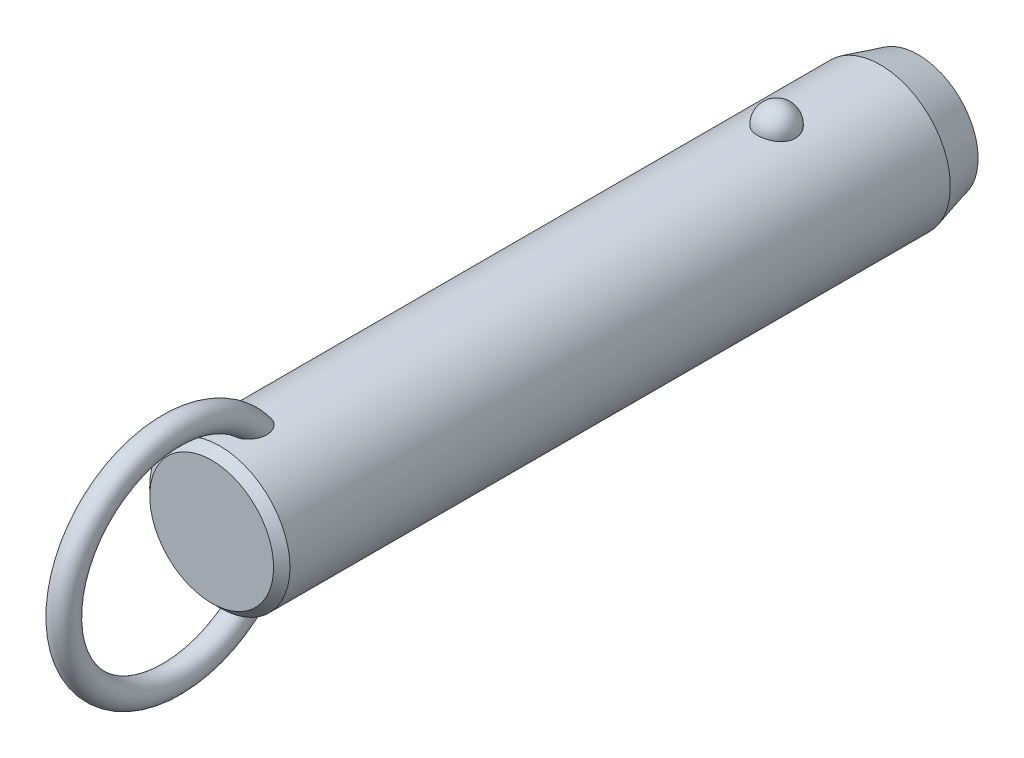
ISO-10303-21;
HEADER;
FILE_DESCRIPTION(('STEP AP214'),'2;1');
FILE_NAME('part.step','',(''),(''),'','','');
FILE_SCHEMA(('AUTOMOTIVE_DESIGN { 1 0 10303 214 1 1 1 1 }'));
ENDSEC;
DATA;
#1=APPLICATION_CONTEXT('core data for automotive mechanical design processes');
#2=APPLICATION_PROTOCOL_DEFINITION('international standard','automotive_design',2000,#1);
#3=PRODUCT_CONTEXT('',#1,'mechanical');
#4=PRODUCT('Part','Part','',(#3));
#5=PRODUCT_RELATED_PRODUCT_CATEGORY('part','',(#4));
#6=PRODUCT_DEFINITION_FORMATION('','',#4);
#7=PRODUCT_DEFINITION_CONTEXT('part definition',#1,'design');
#8=PRODUCT_DEFINITION('design','',#6,#7);
#9=PRODUCT_DEFINITION_SHAPE('','',#8);
#10=(LENGTH_UNIT() NAMED_UNIT(*) SI_UNIT(.MILLI.,.METRE.));
#11=(NAMED_UNIT(*) PLANE_ANGLE_UNIT() SI_UNIT($,.RADIAN.));
#12=(NAMED_UNIT(*) SI_UNIT($,.STERADIAN.) SOLID_ANGLE_UNIT());
#13=UNCERTAINTY_MEASURE_WITH_UNIT(LENGTH_MEASURE(1.E-05),#10,'distance_accuracy_value','');
#14=(GEOMETRIC_REPRESENTATION_CONTEXT(3) GLOBAL_UNCERTAINTY_ASSIGNED_CONTEXT((#13)) GLOBAL_UNIT_ASSIGNED_CONTEXT((#10,
#11,#12)) REPRESENTATION_CONTEXT('',''));
#15=CARTESIAN_POINT('',(0.,0.,0.));
#16=DIRECTION('',(0.,0.,1.));
#17=DIRECTION('',(1.,0.,0.));
#18=AXIS2_PLACEMENT_3D('',#15,#16,#17);
#19=CARTESIAN_POINT('',(0.,0.,73.7));
#20=DIRECTION('',(0.,0.,-1.));
#21=DIRECTION('',(-1.,0.,0.));
#22=AXIS2_PLACEMENT_3D('',#19,#20,#21);
#23=CYLINDRICAL_SURFACE('',#22,11.1);
#24=CARTESIAN_POINT('',(2.9724815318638,10.6945945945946,-3.));
#25=CARTESIAN_POINT('',(2.97247830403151,10.6945972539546,-2.83225059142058));
#26=CARTESIAN_POINT('',(2.95876598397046,10.6984356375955,-2.66445972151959));
#27=CARTESIAN_POINT('',(2.90424529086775,10.7133624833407,-2.33362381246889));
#28=CARTESIAN_POINT('',(2.8634252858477,10.7244540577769,-2.1705808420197));
#29=CARTESIAN_POINT('',(2.75573657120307,10.7526272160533,-1.85396767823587));
#30=CARTESIAN_POINT('',(2.68887937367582,10.7697061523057,-1.70039333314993));
#31=CARTESIAN_POINT('',(2.53079696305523,10.8079438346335,-1.40691598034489));
#32=CARTESIAN_POINT('',(2.43957264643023,10.8291024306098,-1.2670124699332));
#33=CARTESIAN_POINT('',(2.23458150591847,10.8732541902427,-1.00409565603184));
#34=CARTESIAN_POINT('',(2.12071295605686,10.8962553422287,-0.881162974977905));
#35=CARTESIAN_POINT('',(1.87365402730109,10.9414421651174,-0.656352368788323));
#36=CARTESIAN_POINT('',(1.74046358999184,10.9636278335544,-0.554474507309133));
#37=CARTESIAN_POINT('',(1.45872188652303,11.0046495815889,-0.374872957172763));
#38=CARTESIAN_POINT('',(1.31021276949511,11.0234944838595,-0.297085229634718));
#39=CARTESIAN_POINT('',(1.00170030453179,11.0557957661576,-0.167529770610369));
#40=CARTESIAN_POINT('',(0.841698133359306,11.0692526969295,-0.115759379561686));
#41=CARTESIAN_POINT('',(0.517607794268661,11.0890932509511,-0.0403925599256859));
#42=CARTESIAN_POINT('',(0.353633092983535,11.0955916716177,-0.0163383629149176));
#43=CARTESIAN_POINT('',(0.0238420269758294,11.1011989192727,0.0044517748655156));
#44=CARTESIAN_POINT('',(-0.141974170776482,11.1003084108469,0.00119017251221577));
#45=CARTESIAN_POINT('',(-0.468405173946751,11.0912990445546,-0.0323233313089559));
#46=CARTESIAN_POINT('',(-0.629059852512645,11.0832767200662,-0.0622147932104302));
#47=CARTESIAN_POINT('',(-0.942937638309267,11.0609962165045,-0.147645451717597));
#48=CARTESIAN_POINT('',(-1.09616062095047,11.0467379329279,-0.203185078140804));
#49=CARTESIAN_POINT('',(-1.39181061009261,11.0134071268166,-0.3387529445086));
#50=CARTESIAN_POINT('',(-1.53417383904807,10.9943086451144,-0.418913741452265));
#51=CARTESIAN_POINT('',(-1.80342160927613,10.9533667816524,-0.60144882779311));
#52=CARTESIAN_POINT('',(-1.9303046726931,10.9315231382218,-0.703825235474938));
#53=CARTESIAN_POINT('',(-2.16747598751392,10.887005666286,-0.930091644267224));
#54=CARTESIAN_POINT('',(-2.27742774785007,10.8643239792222,-1.05433291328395));
#55=CARTESIAN_POINT('',(-2.47517316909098,10.8209886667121,-1.31966633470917));
#56=CARTESIAN_POINT('',(-2.56296538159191,10.8003351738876,-1.46075958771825));
#57=CARTESIAN_POINT('',(-2.71500300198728,10.7631304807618,-1.75753646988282));
#58=CARTESIAN_POINT('',(-2.77898901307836,10.7466250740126,-1.91335887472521));
#59=CARTESIAN_POINT('',(-2.88046189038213,10.7198747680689,-2.2339152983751));
#60=CARTESIAN_POINT('',(-2.91794947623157,10.709629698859,-2.39864907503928));
#61=CARTESIAN_POINT('',(-2.96537819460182,10.6965949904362,-2.73165170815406));
#62=CARTESIAN_POINT('',(-2.97542891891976,10.693775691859,-2.89990378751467));
#63=CARTESIAN_POINT('',(-2.96804271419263,10.6958279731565,-3.235752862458));
#64=CARTESIAN_POINT('',(-2.95060646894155,10.7006993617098,-3.40334987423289));
#65=CARTESIAN_POINT('',(-2.88883358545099,10.71753912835,-3.73233906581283));
#66=CARTESIAN_POINT('',(-2.84462026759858,10.7294749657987,-3.89375610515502));
#67=CARTESIAN_POINT('',(-2.73050447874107,10.7590797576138,-4.20667949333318));
#68=CARTESIAN_POINT('',(-2.66060103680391,10.7767489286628,-4.35818546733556));
#69=CARTESIAN_POINT('',(-2.49642559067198,10.8159599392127,-4.6478542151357));
#70=CARTESIAN_POINT('',(-2.40203047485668,10.8375211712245,-4.78594458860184));
#71=CARTESIAN_POINT('',(-2.19143488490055,10.8820570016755,-5.0441038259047));
#72=CARTESIAN_POINT('',(-2.07523364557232,10.9050316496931,-5.16417205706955));
#73=CARTESIAN_POINT('',(-1.82361254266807,10.9499219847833,-5.38334833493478));
#74=CARTESIAN_POINT('',(-1.68812945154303,10.9718338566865,-5.48238464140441));
#75=CARTESIAN_POINT('',(-1.40191298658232,11.0120611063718,-5.65618873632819));
#76=CARTESIAN_POINT('',(-1.25118062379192,11.0303767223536,-5.73095813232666));
#77=CARTESIAN_POINT('',(-0.940570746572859,11.0611653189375,-5.85334725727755));
#78=CARTESIAN_POINT('',(-0.780821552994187,11.0737044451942,-5.90127578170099));
#79=CARTESIAN_POINT('',(-0.455204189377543,11.0918598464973,-5.96992976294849));
#80=CARTESIAN_POINT('',(-0.289336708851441,11.0974768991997,-5.99065827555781));
#81=CARTESIAN_POINT('',(0.0406846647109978,11.1011307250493,-6.00418773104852));
#82=CARTESIAN_POINT('',(0.204817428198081,11.099299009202,-5.99747318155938));
#83=CARTESIAN_POINT('',(0.5295530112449,11.088551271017,-5.9574031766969));
#84=CARTESIAN_POINT('',(0.69015594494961,11.0796354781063,-5.92404858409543));
#85=CARTESIAN_POINT('',(1.0027760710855,11.0557204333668,-5.83180084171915));
#86=CARTESIAN_POINT('',(1.15482001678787,11.0407414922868,-5.77299291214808));
#87=CARTESIAN_POINT('',(1.44678373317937,11.0062913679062,-5.63147366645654));
#88=CARTESIAN_POINT('',(1.58670279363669,10.9868199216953,-5.54876095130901));
#89=CARTESIAN_POINT('',(1.8527023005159,10.9451315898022,-5.36027644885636));
#90=CARTESIAN_POINT('',(1.97855158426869,10.9228788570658,-5.25418644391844));
#91=CARTESIAN_POINT('',(2.21080872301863,10.8782509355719,-5.02251354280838));
#92=CARTESIAN_POINT('',(2.31721312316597,10.8558757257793,-4.89692718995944));
#93=CARTESIAN_POINT('',(2.5094551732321,10.8130715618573,-4.62745408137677));
#94=CARTESIAN_POINT('',(2.59493284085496,10.7926798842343,-4.48330448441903));
#95=CARTESIAN_POINT('',(2.740862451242,10.7565495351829,-4.18236358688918));
#96=CARTESIAN_POINT('',(2.80132490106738,10.7408089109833,-4.02557762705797));
#97=CARTESIAN_POINT('',(2.88959070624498,10.7173718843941,-3.72475308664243));
#98=CARTESIAN_POINT('',(2.92062102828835,10.7088950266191,-3.58171216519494));
#99=CARTESIAN_POINT('',(2.96206765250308,10.6975052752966,-3.29245795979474));
#100=CARTESIAN_POINT('',(2.97248434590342,10.6945922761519,-3.14624473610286));
#101=CARTESIAN_POINT('',(2.9724815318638,10.6945945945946,-3.));
#102=B_SPLINE_CURVE_WITH_KNOTS('',3,(#24,#25,#26,#27,#28,#29,#30,#31,#32,#33,#34,#35,#36,#37,
#38,#39,#40,#41,#42,#43,#44,#45,#46,#47,#48,#49,#50,#51,#52,#53,#54,#55,#56,#57,#58,#59,#60,#61,
#62,#63,#64,#65,#66,#67,#68,#69,#70,#71,#72,#73,#74,#75,#76,#77,#78,#79,#80,#81,#82,#83,#84,#85,
#86,#87,#88,#89,#90,#91,#92,#93,#94,#95,#96,#97,#98,#99,#100,#101),.UNSPECIFIED.,.T.,.F.,(4,2,2,
2,2,2,2,2,2,2,2,2,2,2,2,2,2,2,2,2,2,2,2,2,2,2,2,2,2,2,2,2,2,2,2,2,2,2,4),(0.,0.502722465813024,
1.00566079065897,1.5083769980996,2.01107471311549,2.51608392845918,3.02109467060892,
3.52475118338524,4.02835620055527,4.523518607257,5.0186364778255,5.50715297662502,
5.9956776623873,6.48688002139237,6.97812923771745,7.47814366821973,7.9781907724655,
8.48353712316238,8.9888697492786,9.49218093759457,9.99547960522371,10.4964777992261,
10.997494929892,11.5010810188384,12.0046847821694,12.5099796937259,13.0152411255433,
13.5145635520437,14.0138298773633,14.5043200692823,14.9947943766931,15.4836390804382,
15.9725123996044,16.4685040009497,16.9645836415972,17.4686765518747,17.972557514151,
18.410841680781,18.849117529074),.UNSPECIFIED.);
#103=CARTESIAN_POINT('',(2.9724815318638,10.6945945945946,-3.));
#104=VERTEX_POINT('',#103);
#105=EDGE_CURVE('E41',#104,#104,#102,.T.);
#106=ORIENTED_EDGE('',*,*,#105,.T.);
#107=EDGE_LOOP('',(#106));
#108=FACE_BOUND('',#107,.T.);
#109=CARTESIAN_POINT('',(0.,0.,85.1));
#110=DIRECTION('',(0.,0.,1.));
#111=DIRECTION('',(1.,0.,0.));
#112=AXIS2_PLACEMENT_3D('',#109,#110,#111);
#113=CIRCLE('',#112,11.1);
#114=CARTESIAN_POINT('',(11.1,0.,85.1));
#115=VERTEX_POINT('',#114);
#116=EDGE_CURVE('E10',#115,#115,#113,.F.);
#117=ORIENTED_EDGE('',*,*,#116,.T.);
#118=EDGE_LOOP('',(#117));
#119=FACE_BOUND('',#118,.T.);
#120=CARTESIAN_POINT('',(-0.564520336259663,-11.0856356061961,77.3578154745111));
#121=CARTESIAN_POINT('',(-0.667202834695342,-11.0804062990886,77.3912839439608));
#122=CARTESIAN_POINT('',(-0.766875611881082,-11.0738877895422,77.4338357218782));
#123=CARTESIAN_POINT('',(-0.957284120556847,-11.0590576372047,77.5354190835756));
#124=CARTESIAN_POINT('',(-1.04801616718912,-11.0507452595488,77.5944574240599));
#125=CARTESIAN_POINT('',(-1.21800952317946,-11.0333016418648,77.7265293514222));
#126=CARTESIAN_POINT('',(-1.29730805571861,-11.0241732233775,77.7995156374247));
#127=CARTESIAN_POINT('',(-1.44337665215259,-11.0060026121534,77.9570374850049));
#128=CARTESIAN_POINT('',(-1.51014622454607,-10.9969604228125,78.0415734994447));
#129=CARTESIAN_POINT('',(-1.63454620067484,-10.9791841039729,78.2255213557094));
#130=CARTESIAN_POINT('',(-1.69127003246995,-10.9705107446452,78.3255493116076));
#131=CARTESIAN_POINT('',(-1.78980785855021,-10.9548648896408,78.5327902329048));
#132=CARTESIAN_POINT('',(-1.83161214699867,-10.9478935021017,78.6400078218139));
#133=CARTESIAN_POINT('',(-1.91557028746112,-10.9335803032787,78.9054080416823));
#134=CARTESIAN_POINT('',(-1.95040620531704,-10.9273269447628,79.0659806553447));
#135=CARTESIAN_POINT('',(-1.99388326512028,-10.9194709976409,79.3906977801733));
#136=CARTESIAN_POINT('',(-2.00248051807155,-10.9178762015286,79.5548478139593));
#137=CARTESIAN_POINT('',(-1.99551615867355,-10.9191578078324,79.9246504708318));
#138=CARTESIAN_POINT('',(-1.9732206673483,-10.9232807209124,80.1301911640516));
#139=CARTESIAN_POINT('',(-1.91529761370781,-10.9335244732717,80.433595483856));
#140=CARTESIAN_POINT('',(-1.8918457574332,-10.9376266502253,80.5340883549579));
#141=CARTESIAN_POINT('',(-1.83700674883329,-10.9469720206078,80.732855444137));
#142=CARTESIAN_POINT('',(-1.80562070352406,-10.9522150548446,80.8311299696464));
#143=CARTESIAN_POINT('',(-1.73463055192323,-10.9636837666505,81.0259148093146));
#144=CARTESIAN_POINT('',(-1.69493416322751,-10.9699202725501,81.1223907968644));
#145=CARTESIAN_POINT('',(-1.6074514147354,-10.9830806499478,81.3116262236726));
#146=CARTESIAN_POINT('',(-1.55966150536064,-10.9900048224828,81.4043840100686));
#147=CARTESIAN_POINT('',(-1.45591812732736,-11.0042280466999,81.5846907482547));
#148=CARTESIAN_POINT('',(-1.40000013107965,-11.0115253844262,81.6722601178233));
#149=CARTESIAN_POINT('',(-1.27937470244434,-11.0261911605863,81.8410298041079));
#150=CARTESIAN_POINT('',(-1.21467835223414,-11.0335594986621,81.9222379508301));
#151=CARTESIAN_POINT('',(-1.08218150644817,-11.0473027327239,82.0690010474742));
#152=CARTESIAN_POINT('',(-1.01522633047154,-11.0537063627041,82.135309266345));
#153=CARTESIAN_POINT('',(-0.872952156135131,-11.065850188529,82.2583780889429));
#154=CARTESIAN_POINT('',(-0.797642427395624,-11.0715911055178,82.3151491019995));
#155=CARTESIAN_POINT('',(-0.651396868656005,-11.081071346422,82.4075155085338));
#156=CARTESIAN_POINT('',(-0.581712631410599,-11.0849841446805,82.4450491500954));
#157=CARTESIAN_POINT('',(-0.437066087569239,-11.0916271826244,82.5082594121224));
#158=CARTESIAN_POINT('',(-0.362109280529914,-11.0943586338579,82.5339481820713));
#159=CARTESIAN_POINT('',(-0.207828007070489,-11.0983242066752,82.571117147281));
#160=CARTESIAN_POINT('',(-0.128467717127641,-11.0995432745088,82.5824545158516));
#161=CARTESIAN_POINT('',(0.0309101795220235,-11.1002423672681,82.5889658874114));
#162=CARTESIAN_POINT('',(0.110927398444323,-11.0997233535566,82.5841488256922));
#163=CARTESIAN_POINT('',(0.25640659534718,-11.097240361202,82.5609599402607));
#164=CARTESIAN_POINT('',(0.322235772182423,-11.0955074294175,82.5447543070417));
#165=CARTESIAN_POINT('',(0.450635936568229,-11.0910350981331,82.5026008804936));
#166=CARTESIAN_POINT('',(0.51320522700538,-11.0882951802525,82.4766480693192));
#167=CARTESIAN_POINT('',(0.662626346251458,-11.0805620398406,82.4026073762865));
#168=CARTESIAN_POINT('',(0.747127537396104,-11.0751144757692,82.3498452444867));
#169=CARTESIAN_POINT('',(0.906756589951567,-11.0631932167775,82.2317206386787));
#170=CARTESIAN_POINT('',(0.981859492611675,-11.0567168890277,82.1663257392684));
#171=CARTESIAN_POINT('',(1.10712207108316,-11.0447856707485,82.0422633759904));
#172=CARTESIAN_POINT('',(1.15909566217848,-11.0394280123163,81.9853831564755));
#173=CARTESIAN_POINT('',(1.25791923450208,-11.0286040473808,81.8673271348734));
#174=CARTESIAN_POINT('',(1.30476642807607,-11.0231376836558,81.8061490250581));
#175=CARTESIAN_POINT('',(1.43818612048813,-11.0068027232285,81.617305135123));
#176=CARTESIAN_POINT('',(1.51751767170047,-10.9960104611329,81.4844531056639));
#177=CARTESIAN_POINT('',(1.63597546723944,-10.9788847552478,81.2531371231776));
#178=CARTESIAN_POINT('',(1.67988876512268,-10.9722190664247,81.1570530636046));
#179=CARTESIAN_POINT('',(1.75953241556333,-10.9597298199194,80.9614311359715));
#180=CARTESIAN_POINT('',(1.79525967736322,-10.9539065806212,80.8618919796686));
#181=CARTESIAN_POINT('',(1.85844731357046,-10.9433632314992,80.6602111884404));
#182=CARTESIAN_POINT('',(1.88591073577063,-10.9386427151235,80.5580705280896));
#183=CARTESIAN_POINT('',(1.93234324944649,-10.9305350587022,80.3518191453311));
#184=CARTESIAN_POINT('',(1.95131065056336,-10.9271481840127,80.2477080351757));
#185=CARTESIAN_POINT('',(1.99040203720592,-10.9201183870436,79.9654588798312));
#186=CARTESIAN_POINT('',(2.00221217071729,-10.9179256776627,79.7860370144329));
#187=CARTESIAN_POINT('',(1.99711676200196,-10.9188636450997,79.4277133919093));
#188=CARTESIAN_POINT('',(1.98026150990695,-10.9219849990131,79.248811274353));
#189=CARTESIAN_POINT('',(1.92151657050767,-10.9324473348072,78.9364514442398));
#190=CARTESIAN_POINT('',(1.88605081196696,-10.9386915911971,78.8017594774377));
#191=CARTESIAN_POINT('',(1.7939302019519,-10.9541780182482,78.5399669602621));
#192=CARTESIAN_POINT('',(1.73729868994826,-10.9634168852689,78.4128582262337));
#193=CARTESIAN_POINT('',(1.612370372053,-10.9824218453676,78.1894184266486));
#194=CARTESIAN_POINT('',(1.54715374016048,-10.9918945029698,78.0913455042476));
#195=CARTESIAN_POINT('',(1.40127026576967,-11.0114415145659,77.9074341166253));
#196=CARTESIAN_POINT('',(1.32060742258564,-11.0215157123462,77.8215924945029));
#197=CARTESIAN_POINT('',(1.14474787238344,-11.041168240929,77.6651630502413));
#198=CARTESIAN_POINT('',(1.04947805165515,-11.0507437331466,77.5946565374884));
#199=CARTESIAN_POINT('',(0.847278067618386,-11.0680789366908,77.472640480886));
#200=CARTESIAN_POINT('',(0.74035174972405,-11.0758392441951,77.4211246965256));
#201=CARTESIAN_POINT('',(0.52928931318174,-11.0878275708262,77.3434852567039));
#202=CARTESIAN_POINT('',(0.425895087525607,-11.0923259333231,77.315377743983));
#203=CARTESIAN_POINT('',(0.215723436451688,-11.0984001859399,77.2777038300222));
#204=CARTESIAN_POINT('',(0.108947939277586,-11.0999777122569,77.2681270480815));
#205=CARTESIAN_POINT('',(-0.0938962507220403,-11.1000196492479,77.2678773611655));
#206=CARTESIAN_POINT('',(-0.189967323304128,-11.0987797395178,77.2754089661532));
#207=CARTESIAN_POINT('',(-0.379657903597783,-11.0939111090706,77.3055079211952));
#208=CARTESIAN_POINT('',(-0.473277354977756,-11.0902823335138,77.3280756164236));
#209=CARTESIAN_POINT('',(-0.564520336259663,-11.0856356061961,77.3578154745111));
#210=B_SPLINE_CURVE_WITH_KNOTS('',3,(#120,#121,#122,#123,#124,#125,#126,#127,#128,#129,#130,
#131,#132,#133,#134,#135,#136,#137,#138,#139,#140,#141,#142,#143,#144,#145,#146,#147,#148,#149,
#150,#151,#152,#153,#154,#155,#156,#157,#158,#159,#160,#161,#162,#163,#164,#165,#166,#167,#168,
#169,#170,#171,#172,#173,#174,#175,#176,#177,#178,#179,#180,#181,#182,#183,#184,#185,#186,#187,
#188,#189,#190,#191,#192,#193,#194,#195,#196,#197,#198,#199,#200,#201,#202,#203,#204,#205,#206,
#207,#208,#209),.UNSPECIFIED.,.T.,.F.,(4,2,2,2,2,2,2,2,2,2,2,2,2,2,2,2,2,2,2,2,2,2,2,2,2,2,2,2,
2,2,2,2,2,2,2,2,2,2,2,2,2,2,2,2,4),(0.,0.323999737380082,0.648132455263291,0.971184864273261,
1.29424994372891,1.63886237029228,1.98369857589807,2.47426059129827,2.96564271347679,
3.58257396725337,3.89215258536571,4.20168803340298,4.51486273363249,4.82817514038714,
5.14015911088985,5.45175282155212,5.73442856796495,6.01679375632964,6.25364580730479,
6.49025437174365,6.7291996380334,6.96801276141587,7.17061258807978,7.37331685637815,
7.67094989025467,7.96935728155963,8.20075067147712,8.43226927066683,8.89581623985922,
9.2130653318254,9.53043400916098,9.84768549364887,10.1650000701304,10.70229304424,
11.2386443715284,11.6553390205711,12.0715755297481,12.4245637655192,12.7774607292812,
13.1321855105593,13.4867936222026,13.8068771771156,14.1267813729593,14.4146787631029,
14.7025827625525),.UNSPECIFIED.);
#211=CARTESIAN_POINT('',(-0.564520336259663,-11.0856356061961,77.3578154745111));
#212=VERTEX_POINT('',#211);
#213=EDGE_CURVE('E60',#212,#212,#210,.T.);
#214=ORIENTED_EDGE('',*,*,#213,.T.);
#215=EDGE_LOOP('',(#214));
#216=FACE_BOUND('',#215,.T.);
#217=CARTESIAN_POINT('',(-0.564520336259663,11.0856356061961,77.3578154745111));
#218=CARTESIAN_POINT('',(-0.468542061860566,11.0905203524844,77.3265456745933));
#219=CARTESIAN_POINT('',(-0.36979381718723,11.0942886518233,77.3031576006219));
#220=CARTESIAN_POINT('',(-0.169555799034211,11.0991586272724,77.2730858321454));
#221=CARTESIAN_POINT('',(-0.0680604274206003,11.1002543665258,77.2664393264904));
#222=CARTESIAN_POINT('',(0.134549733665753,11.099646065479,77.2701579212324));
#223=CARTESIAN_POINT('',(0.235664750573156,11.0979441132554,77.2805103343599));
#224=CARTESIAN_POINT('',(0.43463240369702,11.0919342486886,77.3178318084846));
#225=CARTESIAN_POINT('',(0.53248665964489,11.0876276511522,77.3447924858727));
#226=CARTESIAN_POINT('',(0.72244585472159,11.0768742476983,77.4144096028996));
#227=CARTESIAN_POINT('',(0.814543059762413,11.0704246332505,77.4570866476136));
#228=CARTESIAN_POINT('',(0.990565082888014,11.0560659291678,77.5566487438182));
#229=CARTESIAN_POINT('',(1.07448844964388,11.048156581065,77.6135363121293));
#230=CARTESIAN_POINT('',(1.23562672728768,11.0313221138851,77.7422106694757));
#231=CARTESIAN_POINT('',(1.31242684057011,11.0223686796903,77.8145117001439));
#232=CARTESIAN_POINT('',(1.45398030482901,11.0045918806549,77.9700425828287));
#233=CARTESIAN_POINT('',(1.51873073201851,10.9957685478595,78.0532750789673));
#234=CARTESIAN_POINT('',(1.64107232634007,10.9782087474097,78.2363842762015));
#235=CARTESIAN_POINT('',(1.69743176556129,10.9695572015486,78.3370893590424));
#236=CARTESIAN_POINT('',(1.79515063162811,10.9539887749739,78.5456264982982));
#237=CARTESIAN_POINT('',(1.83649966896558,10.9470730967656,78.6534634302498));
#238=CARTESIAN_POINT('',(1.91931148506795,10.9329211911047,78.9203995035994));
#239=CARTESIAN_POINT('',(1.9534010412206,10.9267904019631,79.0818612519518));
#240=CARTESIAN_POINT('',(1.99526195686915,10.9192174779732,79.4082163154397));
#241=CARTESIAN_POINT('',(2.00298989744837,10.9177830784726,79.5731148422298));
#242=CARTESIAN_POINT('',(1.99396251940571,10.9194420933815,79.9441006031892));
#243=CARTESIAN_POINT('',(1.97050829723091,10.923774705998,80.1500387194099));
#244=CARTESIAN_POINT('',(1.91079643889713,10.9343131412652,80.4539019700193));
#245=CARTESIAN_POINT('',(1.88673702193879,10.9385106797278,80.5545296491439));
#246=CARTESIAN_POINT('',(1.83065508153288,10.9480376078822,80.7535107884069));
#247=CARTESIAN_POINT('',(1.79863369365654,10.9533668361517,80.851864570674));
#248=CARTESIAN_POINT('',(1.72633365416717,10.9649954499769,81.046720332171));
#249=CARTESIAN_POINT('',(1.68596409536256,10.9713053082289,81.1431879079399));
#250=CARTESIAN_POINT('',(1.5970799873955,10.9845964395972,81.3323233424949));
#251=CARTESIAN_POINT('',(1.54856169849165,10.9915780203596,81.4249894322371));
#252=CARTESIAN_POINT('',(1.44330168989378,11.0058935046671,81.6049752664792));
#253=CARTESIAN_POINT('',(1.38659749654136,11.0132257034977,81.692316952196));
#254=CARTESIAN_POINT('',(1.26431158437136,11.0279330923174,81.8604563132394));
#255=CARTESIAN_POINT('',(1.19874160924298,11.0353082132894,81.9412624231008));
#256=CARTESIAN_POINT('',(1.06542088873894,11.0489310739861,82.0859856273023));
#257=CARTESIAN_POINT('',(0.998640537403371,11.0552153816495,82.150784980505));
#258=CARTESIAN_POINT('',(0.856896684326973,11.0671032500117,82.270846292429));
#259=CARTESIAN_POINT('',(0.781942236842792,11.0727075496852,82.3261186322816));
#260=CARTESIAN_POINT('',(0.636276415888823,11.081949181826,82.4159721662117));
#261=CARTESIAN_POINT('',(0.5667558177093,11.0857572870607,82.4524410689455));
#262=CARTESIAN_POINT('',(0.422602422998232,11.0921860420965,82.5135333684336));
#263=CARTESIAN_POINT('',(0.347974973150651,11.0948079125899,82.5381689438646));
#264=CARTESIAN_POINT('',(0.194593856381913,11.0985608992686,82.5733233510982));
#265=CARTESIAN_POINT('',(0.115807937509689,11.0996777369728,82.5837069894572));
#266=CARTESIAN_POINT('',(-0.0422499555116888,11.1002003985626,82.5885747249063));
#267=CARTESIAN_POINT('',(-0.121521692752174,11.09960699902,82.583066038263));
#268=CARTESIAN_POINT('',(-0.266046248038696,11.0970123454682,82.5588271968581));
#269=CARTESIAN_POINT('',(-0.331661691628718,11.0952283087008,82.5421356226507));
#270=CARTESIAN_POINT('',(-0.459588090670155,11.0906663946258,82.4991117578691));
#271=CARTESIAN_POINT('',(-0.521897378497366,11.0878880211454,82.472774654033));
#272=CARTESIAN_POINT('',(-0.671446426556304,11.0800342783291,82.3975130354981));
#273=CARTESIAN_POINT('',(-0.756250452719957,11.0744969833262,82.3438182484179));
#274=CARTESIAN_POINT('',(-0.916349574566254,11.0624045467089,82.2238029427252));
#275=CARTESIAN_POINT('',(-0.991618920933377,11.0558467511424,82.1574493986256));
#276=CARTESIAN_POINT('',(-1.11713140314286,11.0437783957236,82.0316335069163));
#277=CARTESIAN_POINT('',(-1.16920539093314,11.0383619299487,81.9739524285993));
#278=CARTESIAN_POINT('',(-1.26817476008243,11.02743010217,81.8542809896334));
#279=CARTESIAN_POINT('',(-1.31506731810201,11.0219146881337,81.7922883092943));
#280=CARTESIAN_POINT('',(-1.40399813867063,11.0109399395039,81.6647843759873));
#281=CARTESIAN_POINT('',(-1.4460286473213,11.0054807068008,81.5992677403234));
#282=CARTESIAN_POINT('',(-1.52538779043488,10.9947621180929,81.4654223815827));
#283=CARTESIAN_POINT('',(-1.56271516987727,10.9895028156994,81.3970929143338));
#284=CARTESIAN_POINT('',(-1.64537943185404,10.9774790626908,81.2332101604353));
#285=CARTESIAN_POINT('',(-1.68879497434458,10.9708503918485,81.1366735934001));
#286=CARTESIAN_POINT('',(-1.76740738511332,10.9584602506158,80.9402369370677));
#287=CARTESIAN_POINT('',(-1.80260120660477,10.95269910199,80.8403356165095));
#288=CARTESIAN_POINT('',(-1.86468657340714,10.9423003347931,80.6379663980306));
#289=CARTESIAN_POINT('',(-1.8915816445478,10.9376622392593,80.5354996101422));
#290=CARTESIAN_POINT('',(-1.93682458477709,10.9297405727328,80.3286429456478));
#291=CARTESIAN_POINT('',(-1.9551708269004,10.9264572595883,80.2242527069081));
#292=CARTESIAN_POINT('',(-1.99232562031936,10.9197647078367,79.9426287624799));
#293=CARTESIAN_POINT('',(-2.00294603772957,10.9177914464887,79.7641857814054));
#294=CARTESIAN_POINT('',(-1.99566675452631,10.9191290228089,79.4079962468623));
#295=CARTESIAN_POINT('',(-1.97781651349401,10.9224306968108,79.2302490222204));
#296=CARTESIAN_POINT('',(-1.91747214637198,10.9331592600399,78.9197921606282));
#297=CARTESIAN_POINT('',(-1.88131022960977,10.9395108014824,78.785825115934));
#298=CARTESIAN_POINT('',(-1.78790380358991,10.9551659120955,78.5255975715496));
#299=CARTESIAN_POINT('',(-1.7306830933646,10.9644661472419,78.3993285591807));
#300=CARTESIAN_POINT('',(-1.60475573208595,10.9835398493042,78.1774156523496));
#301=CARTESIAN_POINT('',(-1.53908879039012,10.9930297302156,78.0800265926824));
#302=CARTESIAN_POINT('',(-1.39238608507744,11.0125708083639,77.8975250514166));
#303=CARTESIAN_POINT('',(-1.31135150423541,11.0226219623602,77.8124116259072));
#304=CARTESIAN_POINT('',(-1.14382035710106,11.0411991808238,77.6652994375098));
#305=CARTESIAN_POINT('',(-1.05858500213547,11.0497792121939,77.6018693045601));
#306=CARTESIAN_POINT('',(-0.878723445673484,11.0655285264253,77.4902505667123));
#307=CARTESIAN_POINT('',(-0.784123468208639,11.0727015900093,77.4420208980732));
#308=CARTESIAN_POINT('',(-0.646163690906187,11.0812501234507,77.386023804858));
#309=CARTESIAN_POINT('',(-0.605595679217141,11.0835451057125,77.3711978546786));
#310=CARTESIAN_POINT('',(-0.564520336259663,11.0856356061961,77.3578154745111));
#311=B_SPLINE_CURVE_WITH_KNOTS('',3,(#217,#218,#219,#220,#221,#222,#223,#224,#225,#226,#227,
#228,#229,#230,#231,#232,#233,#234,#235,#236,#237,#238,#239,#240,#241,#242,#243,#244,#245,#246,
#247,#248,#249,#250,#251,#252,#253,#254,#255,#256,#257,#258,#259,#260,#261,#262,#263,#264,#265,
#266,#267,#268,#269,#270,#271,#272,#273,#274,#275,#276,#277,#278,#279,#280,#281,#282,#283,#284,
#285,#286,#287,#288,#289,#290,#291,#292,#293,#294,#295,#296,#297,#298,#299,#300,#301,#302,#303,
#304,#305,#306,#307,#308,#309,#310),.UNSPECIFIED.,.T.,.F.,(4,2,2,2,2,2,2,2,2,2,2,2,2,2,2,2,2,2,
2,2,2,2,2,2,2,2,2,2,2,2,2,2,2,2,2,2,2,2,2,2,2,2,2,2,2,2,4),(0.,0.303061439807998,
0.606795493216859,0.910302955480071,1.21365733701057,1.51741085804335,1.82121821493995,
2.13745205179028,2.45376252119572,2.79958678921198,3.14564996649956,3.63832391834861,
4.13180893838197,4.75031912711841,5.06071926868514,5.37107516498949,5.68500772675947,
5.99908475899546,6.31176519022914,6.62403542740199,6.90315673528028,7.1819719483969,
7.41687778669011,7.65154134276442,7.88841587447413,8.12518286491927,8.3275284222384,
8.52997509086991,8.82986421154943,9.13054668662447,9.36393502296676,9.59744991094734,
9.83133221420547,10.0652767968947,10.383032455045,10.7009056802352,11.0186436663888,
11.3364420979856,11.8705925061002,12.4038159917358,12.8189662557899,13.2336487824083,
13.5857049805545,13.9377340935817,14.2561354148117,14.5736690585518,14.7033687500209),.UNSPECIFIED.);
#312=CARTESIAN_POINT('',(-0.564520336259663,11.0856356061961,77.3578154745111));
#313=VERTEX_POINT('',#312);
#314=EDGE_CURVE('E68',#313,#313,#311,.T.);
#315=ORIENTED_EDGE('',*,*,#314,.T.);
#316=EDGE_LOOP('',(#315));
#317=FACE_BOUND('',#316,.T.);
#318=CARTESIAN_POINT('',(0.,0.,-19.3999999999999));
#319=DIRECTION('',(0.,0.,-1.));
#320=DIRECTION('',(-1.,0.,0.));
#321=AXIS2_PLACEMENT_3D('',#318,#319,#320);
#322=CIRCLE('',#321,11.1);
#323=CARTESIAN_POINT('',(-11.1,0.,-19.3999999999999));
#324=VERTEX_POINT('',#323);
#325=EDGE_CURVE('E57',#324,#324,#322,.F.);
#326=ORIENTED_EDGE('',*,*,#325,.T.);
#327=EDGE_LOOP('',(#326));
#328=FACE_BOUND('',#327,.T.);
#329=ADVANCED_FACE('F37',(#108,#119,#216,#317,#328),#23,.T.);
#330=CARTESIAN_POINT('',(0.,0.,-25.4));
#331=DIRECTION('',(0.,0.,-1.));
#332=DIRECTION('',(-1.,0.,0.));
#333=AXIS2_PLACEMENT_3D('',#330,#331,#332);
#334=PLANE('',#333);
#335=CARTESIAN_POINT('',(0.,0.,-25.4));
#336=DIRECTION('',(0.,0.,-1.));
#337=DIRECTION('',(-1.,0.,0.));
#338=AXIS2_PLACEMENT_3D('',#335,#336,#337);
#339=CIRCLE('',#338,9.49230484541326);
#340=CARTESIAN_POINT('',(-9.49230484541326,0.,-25.4));
#341=VERTEX_POINT('',#340);
#342=EDGE_CURVE('E67',#341,#341,#339,.T.);
#343=ORIENTED_EDGE('',*,*,#342,.T.);
#344=EDGE_LOOP('',(#343));
#345=FACE_BOUND('',#344,.T.);
#346=ADVANCED_FACE('F86',(#345),#334,.T.);
#347=CARTESIAN_POINT('',(0.,0.,-25.4));
#348=DIRECTION('',(0.,0.,1.));
#349=DIRECTION('',(1.,0.,0.));
#350=AXIS2_PLACEMENT_3D('',#347,#348,#349);
#351=CONICAL_SURFACE('',#350,9.49230484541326,0.261799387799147);
#352=ORIENTED_EDGE('',*,*,#325,.F.);
#353=EDGE_LOOP('',(#352));
#354=FACE_BOUND('',#353,.T.);
#355=ORIENTED_EDGE('',*,*,#342,.F.);
#356=EDGE_LOOP('',(#355));
#357=FACE_BOUND('',#356,.T.);
#358=ADVANCED_FACE('F84',(#354,#357),#351,.T.);
#359=CARTESIAN_POINT('',(0.,0.,86.4));
#360=DIRECTION('',(0.,0.,1.));
#361=DIRECTION('',(1.,0.,0.));
#362=AXIS2_PLACEMENT_3D('',#359,#360,#361);
#363=PLANE('',#362);
#364=CARTESIAN_POINT('',(0.,0.,86.4));
#365=DIRECTION('',(0.,0.,1.));
#366=DIRECTION('',(1.,0.,0.));
#367=AXIS2_PLACEMENT_3D('',#364,#365,#366);
#368=CIRCLE('',#367,9.79999999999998);
#369=CARTESIAN_POINT('',(9.79999999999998,0.,86.4));
#370=VERTEX_POINT('',#369);
#371=EDGE_CURVE('E50',#370,#370,#368,.T.);
#372=ORIENTED_EDGE('',*,*,#371,.T.);
#373=EDGE_LOOP('',(#372));
#374=FACE_BOUND('',#373,.T.);
#375=ADVANCED_FACE('F78',(#374),#363,.T.);
#376=CARTESIAN_POINT('',(0.,0.,92.75));
#377=DIRECTION('',(1.,0.,0.));
#378=DIRECTION('',(0.,0.,-1.));
#379=AXIS2_PLACEMENT_3D('',#376,#377,#378);
#380=TOROIDAL_SURFACE('',#379,17.05,2.);
#381=ORIENTED_EDGE('',*,*,#314,.F.);
#382=EDGE_LOOP('',(#381));
#383=FACE_BOUND('',#382,.T.);
#384=ORIENTED_EDGE('',*,*,#213,.F.);
#385=EDGE_LOOP('',(#384));
#386=FACE_BOUND('',#385,.T.);
#387=ADVANCED_FACE('F74',(#383,#386),#380,.T.);
#388=CARTESIAN_POINT('',(0.,0.,86.4));
#389=DIRECTION('',(0.,0.,-1.));
#390=DIRECTION('',(-1.,0.,0.));
#391=AXIS2_PLACEMENT_3D('',#388,#389,#390);
#392=CONICAL_SURFACE('',#391,9.79999999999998,0.785398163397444);
#393=ORIENTED_EDGE('',*,*,#116,.F.);
#394=EDGE_LOOP('',(#393));
#395=FACE_BOUND('',#394,.T.);
#396=ORIENTED_EDGE('',*,*,#371,.F.);
#397=EDGE_LOOP('',(#396));
#398=FACE_BOUND('',#397,.T.);
#399=ADVANCED_FACE('F39',(#395,#398),#392,.T.);
#400=CARTESIAN_POINT('',(0.,11.1,-3.));
#401=DIRECTION('',(0.,1.,0.));
#402=DIRECTION('',(0.,0.,-1.));
#403=AXIS2_PLACEMENT_3D('',#400,#401,#402);
#404=SPHERICAL_SURFACE('',#403,3.);
#405=ORIENTED_EDGE('',*,*,#105,.F.);
#406=EDGE_LOOP('',(#405));
#407=FACE_BOUND('',#406,.T.);
#408=ADVANCED_FACE('F80',(#407),#404,.T.);
#409=CLOSED_SHELL('',(#329,#346,#358,#375,#387,#399,#408));
#410=MANIFOLD_SOLID_BREP('B2',#409);
#411=ADVANCED_BREP_SHAPE_REPRESENTATION('',(#18,#410),#14);
#412=SHAPE_DEFINITION_REPRESENTATION(#9,#411);
ENDSEC;
END-ISO-10303-21;
